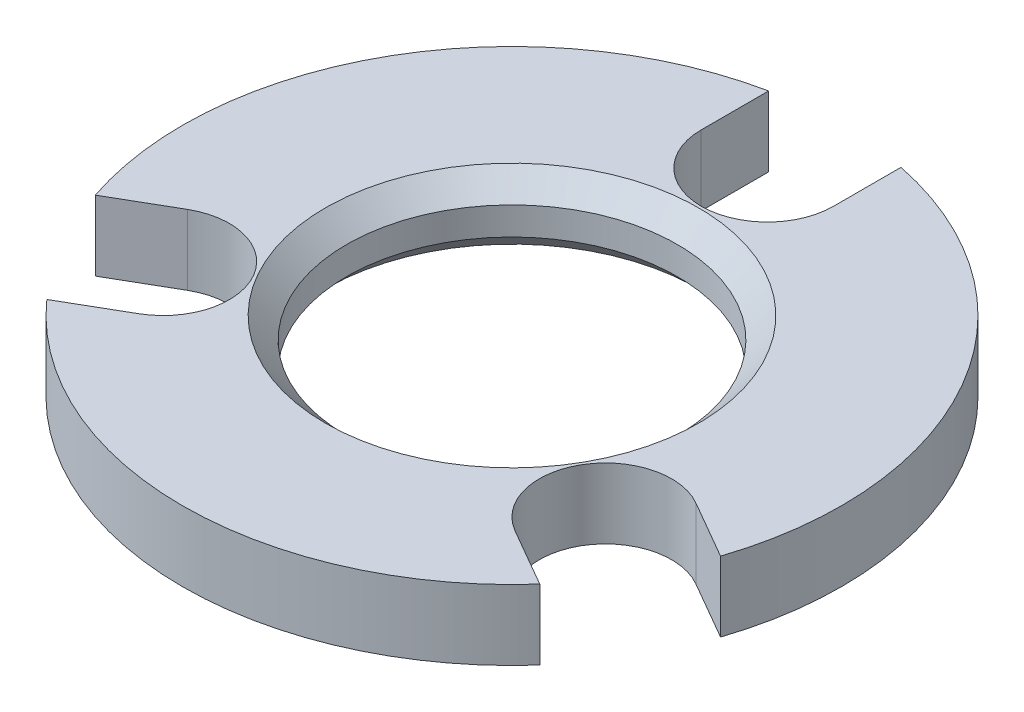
from build123d import *

# Parameters (mm, degrees)
SKETCH1_R           = 31.623
SKETCH1_R_2         = 15.875
BOSS_EXTRUDE1_DEPTH = 6.731
CUT_EXTRUDE1_DEPTH  = 46.22537583
CIRPATTERN1_COUNT   = 3
CHAMFER1_SIZE       = 2.032


with BuildPart() as part:
    # Sketch1 → Boss-Extrude1 (new body)
    with BuildSketch(Plane(origin=(0, 0, 0), x_dir=(1, 0, 0), z_dir=(0, 1, 0))):
        with Locations(Location((0, 0, 0), (0, 0, 270))):
            Circle(SKETCH1_R)
        with Locations(Location((0, 0, 0), (0, 0, 270))):
            Circle(SKETCH1_R_2, mode=Mode.SUBTRACT)
    extrude(amount=BOSS_EXTRUDE1_DEPTH)

    # Sketch2 → Cut-Extrude1 (cut, through all)
    with BuildSketch(Plane(origin=(0, 6.731, 0), x_dir=(1, 0, 0), z_dir=(0, 1, 0))):
        with BuildLine():
            Line((-6.35, 24.511), (-6.35, 31.623))
            Line((-6.35, 31.623), (6.35, 31.623))
            Line((6.35, 31.623), (6.35, 24.511))
            ThreePointArc((6.35, 24.511), (0, 18.161), (-6.35, 24.511))
        make_face()
    cut_extrude1 = extrude(amount=-CUT_EXTRUDE1_DEPTH, mode=Mode.SUBTRACT)

    # CirPattern1: Cut-Extrude1 ×3 about axis
    cirpattern1_axis = Axis((0, 0, 0), (0, 1, 0))
    for i in range(1, CIRPATTERN1_COUNT):
        add(cut_extrude1.rotate(cirpattern1_axis, i * 360 / CIRPATTERN1_COUNT), mode=Mode.SUBTRACT)

    # Chamfer1
    chamfer1_edges = [part.edges().sort_by_distance(p)[0] for p in [
        (0, 0, -15.875),
        (0, 6.731, -15.875),
    ]]
    chamfer(chamfer1_edges, length=CHAMFER1_SIZE)


solid = part.part
